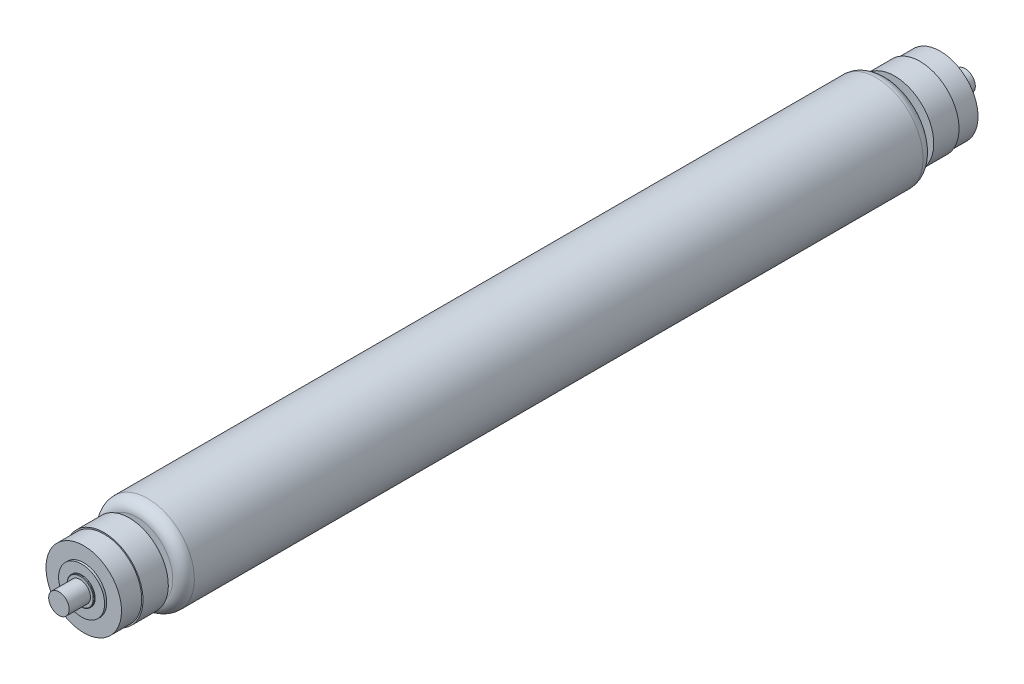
ISO-10303-21;
HEADER;
FILE_DESCRIPTION(('STEP AP214'),'2;1');
FILE_NAME('part.step','',(''),(''),'','','');
FILE_SCHEMA(('AUTOMOTIVE_DESIGN { 1 0 10303 214 1 1 1 1 }'));
ENDSEC;
DATA;
#1=APPLICATION_CONTEXT('core data for automotive mechanical design processes');
#2=APPLICATION_PROTOCOL_DEFINITION('international standard','automotive_design',2000,#1);
#3=PRODUCT_CONTEXT('',#1,'mechanical');
#4=PRODUCT('Part','Part','',(#3));
#5=PRODUCT_RELATED_PRODUCT_CATEGORY('part','',(#4));
#6=PRODUCT_DEFINITION_FORMATION('','',#4);
#7=PRODUCT_DEFINITION_CONTEXT('part definition',#1,'design');
#8=PRODUCT_DEFINITION('design','',#6,#7);
#9=PRODUCT_DEFINITION_SHAPE('','',#8);
#10=(LENGTH_UNIT() NAMED_UNIT(*) SI_UNIT(.MILLI.,.METRE.));
#11=(NAMED_UNIT(*) PLANE_ANGLE_UNIT() SI_UNIT($,.RADIAN.));
#12=(NAMED_UNIT(*) SI_UNIT($,.STERADIAN.) SOLID_ANGLE_UNIT());
#13=UNCERTAINTY_MEASURE_WITH_UNIT(LENGTH_MEASURE(1.E-05),#10,'distance_accuracy_value','');
#14=(GEOMETRIC_REPRESENTATION_CONTEXT(3) GLOBAL_UNCERTAINTY_ASSIGNED_CONTEXT((#13)) GLOBAL_UNIT_ASSIGNED_CONTEXT((#10,
#11,#12)) REPRESENTATION_CONTEXT('',''));
#15=CARTESIAN_POINT('',(0.,0.,0.));
#16=DIRECTION('',(0.,0.,1.));
#17=DIRECTION('',(1.,0.,0.));
#18=AXIS2_PLACEMENT_3D('',#15,#16,#17);
#19=CARTESIAN_POINT('',(0.,0.,0.));
#20=DIRECTION('',(0.,0.,-1.));
#21=DIRECTION('',(0.,1.,0.));
#22=AXIS2_PLACEMENT_3D('',#19,#20,#21);
#23=CYLINDRICAL_SURFACE('',#22,2.41300000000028);
#24=CARTESIAN_POINT('',(0.,0.,0.));
#25=DIRECTION('',(0.,0.,-1.));
#26=DIRECTION('',(0.,1.,0.));
#27=AXIS2_PLACEMENT_3D('',#24,#25,#26);
#28=CIRCLE('',#27,2.4130000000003);
#29=CARTESIAN_POINT('',(0.,2.4130000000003,0.));
#30=VERTEX_POINT('',#29);
#31=EDGE_CURVE('E127',#30,#30,#28,.T.);
#32=ORIENTED_EDGE('',*,*,#31,.F.);
#33=EDGE_LOOP('',(#32));
#34=FACE_BOUND('',#33,.T.);
#35=CARTESIAN_POINT('',(0.,0.,5.00380000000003));
#36=DIRECTION('',(0.,0.,-1.));
#37=DIRECTION('',(0.,1.,0.));
#38=AXIS2_PLACEMENT_3D('',#35,#36,#37);
#39=CIRCLE('',#38,2.41300000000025);
#40=CARTESIAN_POINT('',(0.,2.41300000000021,5.00380000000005));
#41=VERTEX_POINT('',#40);
#42=EDGE_CURVE('E10',#41,#41,#39,.T.);
#43=ORIENTED_EDGE('',*,*,#42,.T.);
#44=EDGE_LOOP('',(#43));
#45=FACE_BOUND('',#44,.T.);
#46=ADVANCED_FACE('F33',(#34,#45),#23,.T.);
#47=CARTESIAN_POINT('',(0.,-3.06447825,5.00379999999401));
#48=DIRECTION('',(0.,0.,1.));
#49=DIRECTION('',(0.,-1.,0.));
#50=AXIS2_PLACEMENT_3D('',#47,#48,#49);
#51=PLANE('',#50);
#52=ORIENTED_EDGE('',*,*,#42,.F.);
#53=EDGE_LOOP('',(#52));
#54=FACE_BOUND('',#53,.T.);
#55=CARTESIAN_POINT('',(0.,0.,5.00379999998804));
#56=DIRECTION('',(0.,0.,-1.));
#57=DIRECTION('',(0.,1.,0.));
#58=AXIS2_PLACEMENT_3D('',#55,#56,#57);
#59=CIRCLE('',#58,3.06447824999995);
#60=CARTESIAN_POINT('',(0.,3.06447824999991,5.00379999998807));
#61=VERTEX_POINT('',#60);
#62=EDGE_CURVE('E39',#61,#61,#59,.T.);
#63=ORIENTED_EDGE('',*,*,#62,.T.);
#64=EDGE_LOOP('',(#63));
#65=FACE_BOUND('',#64,.T.);
#66=ADVANCED_FACE('F134',(#54,#65),#51,.F.);
#67=CARTESIAN_POINT('',(0.,0.,5.13199024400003));
#68=DIRECTION('',(0.,0.,1.));
#69=DIRECTION('',(0.,-1.,0.));
#70=AXIS2_PLACEMENT_3D('',#67,#68,#69);
#71=CONICAL_SURFACE('',#70,3.19266874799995,0.785399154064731);
#72=ORIENTED_EDGE('',*,*,#62,.F.);
#73=EDGE_LOOP('',(#72));
#74=FACE_BOUND('',#73,.T.);
#75=CARTESIAN_POINT('',(0.,0.,5.13199024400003));
#76=DIRECTION('',(0.,0.,-1.));
#77=DIRECTION('',(0.,1.,0.));
#78=AXIS2_PLACEMENT_3D('',#75,#76,#77);
#79=CIRCLE('',#78,3.19266874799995);
#80=CARTESIAN_POINT('',(0.,3.19266874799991,5.13199024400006));
#81=VERTEX_POINT('',#80);
#82=EDGE_CURVE('E43',#81,#81,#79,.T.);
#83=ORIENTED_EDGE('',*,*,#82,.T.);
#84=EDGE_LOOP('',(#83));
#85=FACE_BOUND('',#84,.T.);
#86=ADVANCED_FACE('F138',(#74,#85),#71,.T.);
#87=CARTESIAN_POINT('',(0.,0.,0.));
#88=DIRECTION('',(0.,0.,-1.));
#89=DIRECTION('',(0.,1.,0.));
#90=AXIS2_PLACEMENT_3D('',#87,#88,#89);
#91=CYLINDRICAL_SURFACE('',#90,3.1926687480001);
#92=ORIENTED_EDGE('',*,*,#82,.F.);
#93=EDGE_LOOP('',(#92));
#94=FACE_BOUND('',#93,.T.);
#95=CARTESIAN_POINT('',(0.,0.,5.33400000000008));
#96=DIRECTION('',(0.,0.,-1.));
#97=DIRECTION('',(0.,1.,0.));
#98=AXIS2_PLACEMENT_3D('',#95,#96,#97);
#99=CIRCLE('',#98,3.19266874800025);
#100=CARTESIAN_POINT('',(0.,3.1926687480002,5.33400000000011));
#101=VERTEX_POINT('',#100);
#102=EDGE_CURVE('E47',#101,#101,#99,.T.);
#103=ORIENTED_EDGE('',*,*,#102,.T.);
#104=EDGE_LOOP('',(#103));
#105=FACE_BOUND('',#104,.T.);
#106=ADVANCED_FACE('F143',(#94,#105),#91,.T.);
#107=CARTESIAN_POINT('',(0.,-5.4102,5.33400000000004));
#108=DIRECTION('',(0.,0.,1.));
#109=DIRECTION('',(0.,-1.,0.));
#110=AXIS2_PLACEMENT_3D('',#107,#108,#109);
#111=PLANE('',#110);
#112=ORIENTED_EDGE('',*,*,#102,.F.);
#113=EDGE_LOOP('',(#112));
#114=FACE_BOUND('',#113,.T.);
#115=CARTESIAN_POINT('',(0.,0.,5.33400000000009));
#116=DIRECTION('',(0.,0.,-1.));
#117=DIRECTION('',(0.,1.,0.));
#118=AXIS2_PLACEMENT_3D('',#115,#116,#117);
#119=CIRCLE('',#118,5.41019999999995);
#120=CARTESIAN_POINT('',(0.,5.4101999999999,5.33400000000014));
#121=VERTEX_POINT('',#120);
#122=EDGE_CURVE('E52',#121,#121,#119,.T.);
#123=ORIENTED_EDGE('',*,*,#122,.T.);
#124=EDGE_LOOP('',(#123));
#125=FACE_BOUND('',#124,.T.);
#126=ADVANCED_FACE('F149',(#114,#125),#111,.F.);
#127=CARTESIAN_POINT('',(0.,0.,0.));
#128=DIRECTION('',(0.,0.,-1.));
#129=DIRECTION('',(0.,1.,0.));
#130=AXIS2_PLACEMENT_3D('',#127,#128,#129);
#131=CYLINDRICAL_SURFACE('',#130,5.41019999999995);
#132=ORIENTED_EDGE('',*,*,#122,.F.);
#133=EDGE_LOOP('',(#132));
#134=FACE_BOUND('',#133,.T.);
#135=CARTESIAN_POINT('',(0.,0.,5.84200000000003));
#136=DIRECTION('',(0.,0.,-1.));
#137=DIRECTION('',(0.,1.,0.));
#138=AXIS2_PLACEMENT_3D('',#135,#136,#137);
#139=CIRCLE('',#138,5.41019999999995);
#140=CARTESIAN_POINT('',(0.,5.41019999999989,5.84200000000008));
#141=VERTEX_POINT('',#140);
#142=EDGE_CURVE('E55',#141,#141,#139,.T.);
#143=ORIENTED_EDGE('',*,*,#142,.T.);
#144=EDGE_LOOP('',(#143));
#145=FACE_BOUND('',#144,.T.);
#146=ADVANCED_FACE('F153',(#134,#145),#131,.T.);
#147=CARTESIAN_POINT('',(0.,-8.884691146,5.84199999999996));
#148=DIRECTION('',(0.,0.,1.));
#149=DIRECTION('',(0.,-1.,0.));
#150=AXIS2_PLACEMENT_3D('',#147,#148,#149);
#151=PLANE('',#150);
#152=ORIENTED_EDGE('',*,*,#142,.F.);
#153=EDGE_LOOP('',(#152));
#154=FACE_BOUND('',#153,.T.);
#155=CARTESIAN_POINT('',(0.,0.,5.84200000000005));
#156=DIRECTION('',(0.,0.,-1.));
#157=DIRECTION('',(0.,1.,0.));
#158=AXIS2_PLACEMENT_3D('',#155,#156,#157);
#159=CIRCLE('',#158,8.88469114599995);
#160=CARTESIAN_POINT('',(0.,8.88469114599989,5.84200000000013));
#161=VERTEX_POINT('',#160);
#162=EDGE_CURVE('E58',#161,#161,#159,.T.);
#163=ORIENTED_EDGE('',*,*,#162,.T.);
#164=EDGE_LOOP('',(#163));
#165=FACE_BOUND('',#164,.T.);
#166=ADVANCED_FACE('F157',(#154,#165),#151,.F.);
#167=CARTESIAN_POINT('',(0.,0.,0.));
#168=DIRECTION('',(0.,0.,-1.));
#169=DIRECTION('',(0.,1.,0.));
#170=AXIS2_PLACEMENT_3D('',#167,#168,#169);
#171=CYLINDRICAL_SURFACE('',#170,8.88469114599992);
#172=ORIENTED_EDGE('',*,*,#162,.F.);
#173=EDGE_LOOP('',(#172));
#174=FACE_BOUND('',#173,.T.);
#175=CARTESIAN_POINT('',(0.,0.,10.6045000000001));
#176=DIRECTION('',(0.,0.,-1.));
#177=DIRECTION('',(0.,1.,0.));
#178=AXIS2_PLACEMENT_3D('',#175,#176,#177);
#179=CIRCLE('',#178,8.8846911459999);
#180=CARTESIAN_POINT('',(0.,8.88469114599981,10.6045000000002));
#181=VERTEX_POINT('',#180);
#182=EDGE_CURVE('E61',#181,#181,#179,.T.);
#183=ORIENTED_EDGE('',*,*,#182,.T.);
#184=EDGE_LOOP('',(#183));
#185=FACE_BOUND('',#184,.T.);
#186=ADVANCED_FACE('F161',(#174,#185),#171,.T.);
#187=CARTESIAN_POINT('',(0.,-9.1821,10.6045));
#188=DIRECTION('',(0.,0.,1.));
#189=DIRECTION('',(0.,-1.,0.));
#190=AXIS2_PLACEMENT_3D('',#187,#188,#189);
#191=PLANE('',#190);
#192=ORIENTED_EDGE('',*,*,#182,.F.);
#193=EDGE_LOOP('',(#192));
#194=FACE_BOUND('',#193,.T.);
#195=CARTESIAN_POINT('',(0.,0.,10.6045000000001));
#196=DIRECTION('',(0.,0.,-1.));
#197=DIRECTION('',(0.,1.,0.));
#198=AXIS2_PLACEMENT_3D('',#195,#196,#197);
#199=CIRCLE('',#198,9.1820999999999);
#200=CARTESIAN_POINT('',(0.,9.1820999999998,10.6045000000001));
#201=VERTEX_POINT('',#200);
#202=EDGE_CURVE('E64',#201,#201,#199,.T.);
#203=ORIENTED_EDGE('',*,*,#202,.T.);
#204=EDGE_LOOP('',(#203));
#205=FACE_BOUND('',#204,.T.);
#206=ADVANCED_FACE('F165',(#194,#205),#191,.F.);
#207=CARTESIAN_POINT('',(0.,0.,0.));
#208=DIRECTION('',(0.,0.,-1.));
#209=DIRECTION('',(0.,1.,0.));
#210=AXIS2_PLACEMENT_3D('',#207,#208,#209);
#211=CYLINDRICAL_SURFACE('',#210,9.18210000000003);
#212=ORIENTED_EDGE('',*,*,#202,.F.);
#213=EDGE_LOOP('',(#212));
#214=FACE_BOUND('',#213,.T.);
#215=CARTESIAN_POINT('',(0.,-1.51372246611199E-13,16.5608000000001));
#216=DIRECTION('',(0.,0.,-1.));
#217=DIRECTION('',(0.,1.,0.));
#218=AXIS2_PLACEMENT_3D('',#215,#216,#217);
#219=CIRCLE('',#218,9.18210000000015);
#220=CARTESIAN_POINT('',(0.,9.1821,16.5608000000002));
#221=VERTEX_POINT('',#220);
#222=EDGE_CURVE('E67',#221,#221,#219,.T.);
#223=ORIENTED_EDGE('',*,*,#222,.T.);
#224=EDGE_LOOP('',(#223));
#225=FACE_BOUND('',#224,.T.);
#226=ADVANCED_FACE('F169',(#214,#225),#211,.T.);
#227=CARTESIAN_POINT('',(0.,-6.3499999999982,16.5608000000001));
#228=DIRECTION('',(0.,0.,-1.));
#229=DIRECTION('',(0.,1.,0.));
#230=AXIS2_PLACEMENT_3D('',#227,#228,#229);
#231=PLANE('',#230);
#232=ORIENTED_EDGE('',*,*,#222,.F.);
#233=EDGE_LOOP('',(#232));
#234=FACE_BOUND('',#233,.T.);
#235=CARTESIAN_POINT('',(0.,-1.51372246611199E-13,16.5608000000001));
#236=DIRECTION('',(0.,0.,-1.));
#237=DIRECTION('',(0.,1.,0.));
#238=AXIS2_PLACEMENT_3D('',#235,#236,#237);
#239=CIRCLE('',#238,6.34999999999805);
#240=CARTESIAN_POINT('',(0.,6.3499999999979,16.5608000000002));
#241=VERTEX_POINT('',#240);
#242=EDGE_CURVE('E70',#241,#241,#239,.T.);
#243=ORIENTED_EDGE('',*,*,#242,.T.);
#244=EDGE_LOOP('',(#243));
#245=FACE_BOUND('',#244,.T.);
#246=ADVANCED_FACE('F173',(#234,#245),#231,.F.);
#247=CARTESIAN_POINT('',(0.,-1.67623868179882E-13,18.3387999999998));
#248=DIRECTION('',(0.,0.,-1.));
#249=DIRECTION('',(0.,1.,0.));
#250=AXIS2_PLACEMENT_3D('',#247,#248,#249);
#251=CONICAL_SURFACE('',#250,4.20728205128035,0.878154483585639);
#252=ORIENTED_EDGE('',*,*,#242,.F.);
#253=EDGE_LOOP('',(#252));
#254=FACE_BOUND('',#253,.T.);
#255=CARTESIAN_POINT('',(0.,-1.67623868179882E-13,18.3387999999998));
#256=DIRECTION('',(0.,0.,-1.));
#257=DIRECTION('',(0.,1.,0.));
#258=AXIS2_PLACEMENT_3D('',#255,#256,#257);
#259=CIRCLE('',#258,4.20728205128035);
#260=CARTESIAN_POINT('',(0.,4.20728205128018,18.3387999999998));
#261=VERTEX_POINT('',#260);
#262=EDGE_CURVE('E73',#261,#261,#259,.T.);
#263=ORIENTED_EDGE('',*,*,#262,.T.);
#264=EDGE_LOOP('',(#263));
#265=FACE_BOUND('',#264,.T.);
#266=ADVANCED_FACE('F177',(#254,#265),#251,.T.);
#267=CARTESIAN_POINT('',(0.,-4.20728205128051,18.3387999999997));
#268=DIRECTION('',(0.,0.,1.));
#269=DIRECTION('',(0.,-1.,0.));
#270=AXIS2_PLACEMENT_3D('',#267,#268,#269);
#271=PLANE('',#270);
#272=ORIENTED_EDGE('',*,*,#262,.F.);
#273=EDGE_LOOP('',(#272));
#274=FACE_BOUND('',#273,.T.);
#275=CARTESIAN_POINT('',(0.,-1.67623868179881E-13,18.3387999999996));
#276=DIRECTION('',(0.,0.,-1.));
#277=DIRECTION('',(0.,1.,0.));
#278=AXIS2_PLACEMENT_3D('',#275,#276,#277);
#279=CIRCLE('',#278,8.44549999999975);
#280=CARTESIAN_POINT('',(0.,8.44549999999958,18.3387999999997));
#281=VERTEX_POINT('',#280);
#282=EDGE_CURVE('E76',#281,#281,#279,.T.);
#283=ORIENTED_EDGE('',*,*,#282,.T.);
#284=EDGE_LOOP('',(#283));
#285=FACE_BOUND('',#284,.T.);
#286=ADVANCED_FACE('F181',(#274,#285),#271,.F.);
#287=CARTESIAN_POINT('',(0.,-1.90819582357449E-13,20.8787999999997));
#288=DIRECTION('',(0.,0.,-1.));
#289=DIRECTION('',(0.,1.,0.));
#290=AXIS2_PLACEMENT_3D('',#287,#288,#289);
#291=TOROIDAL_SURFACE('',#290,8.44549999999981,2.54);
#292=ORIENTED_EDGE('',*,*,#282,.F.);
#293=EDGE_LOOP('',(#292));
#294=FACE_BOUND('',#293,.T.);
#295=CARTESIAN_POINT('',(0.,-1.90840470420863E-13,20.8787999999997));
#296=DIRECTION('',(0.,0.,-1.));
#297=DIRECTION('',(0.,1.,0.));
#298=AXIS2_PLACEMENT_3D('',#295,#296,#297);
#299=CIRCLE('',#298,10.9854999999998);
#300=CARTESIAN_POINT('',(0.,10.9854999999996,20.8787999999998));
#301=VERTEX_POINT('',#300);
#302=EDGE_CURVE('E79',#301,#301,#299,.T.);
#303=ORIENTED_EDGE('',*,*,#302,.T.);
#304=EDGE_LOOP('',(#303));
#305=FACE_BOUND('',#304,.T.);
#306=ADVANCED_FACE('F185',(#294,#305),#291,.T.);
#307=CARTESIAN_POINT('',(0.,0.,0.));
#308=DIRECTION('',(0.,0.,-1.));
#309=DIRECTION('',(0.,1.,0.));
#310=AXIS2_PLACEMENT_3D('',#307,#308,#309);
#311=CYLINDRICAL_SURFACE('',#310,10.985499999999);
#312=ORIENTED_EDGE('',*,*,#302,.F.);
#313=EDGE_LOOP('',(#312));
#314=FACE_BOUND('',#313,.T.);
#315=CARTESIAN_POINT('',(0.,-1.75796112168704E-12,192.328799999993));
#316=DIRECTION('',(0.,0.,-1.));
#317=DIRECTION('',(0.,1.,0.));
#318=AXIS2_PLACEMENT_3D('',#315,#316,#317);
#319=CIRCLE('',#318,10.9854999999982);
#320=CARTESIAN_POINT('',(0.,10.9854999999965,192.328799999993));
#321=VERTEX_POINT('',#320);
#322=EDGE_CURVE('E82',#321,#321,#319,.T.);
#323=ORIENTED_EDGE('',*,*,#322,.T.);
#324=EDGE_LOOP('',(#323));
#325=FACE_BOUND('',#324,.T.);
#326=ADVANCED_FACE('F189',(#314,#325),#311,.T.);
#327=CARTESIAN_POINT('',(0.,-1.75727488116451E-12,192.328799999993));
#328=DIRECTION('',(0.,0.,-1.));
#329=DIRECTION('',(0.,1.,0.));
#330=AXIS2_PLACEMENT_3D('',#327,#328,#329);
#331=TOROIDAL_SURFACE('',#330,8.44549999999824,2.53999999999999);
#332=ORIENTED_EDGE('',*,*,#322,.F.);
#333=EDGE_LOOP('',(#332));
#334=FACE_BOUND('',#333,.T.);
#335=CARTESIAN_POINT('',(0.,-1.78117772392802E-12,194.868799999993));
#336=DIRECTION('',(0.,0.,-1.));
#337=DIRECTION('',(0.,1.,0.));
#338=AXIS2_PLACEMENT_3D('',#335,#336,#337);
#339=CIRCLE('',#338,8.44549999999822);
#340=CARTESIAN_POINT('',(0.,8.44549999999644,194.868799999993));
#341=VERTEX_POINT('',#340);
#342=EDGE_CURVE('E85',#341,#341,#339,.T.);
#343=ORIENTED_EDGE('',*,*,#342,.T.);
#344=EDGE_LOOP('',(#343));
#345=FACE_BOUND('',#344,.T.);
#346=ADVANCED_FACE('F193',(#334,#345),#331,.T.);
#347=CARTESIAN_POINT('',(0.,-4.20728205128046,194.868799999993));
#348=DIRECTION('',(0.,0.,-1.));
#349=DIRECTION('',(0.,1.,0.));
#350=AXIS2_PLACEMENT_3D('',#347,#348,#349);
#351=PLANE('',#350);
#352=ORIENTED_EDGE('',*,*,#342,.F.);
#353=EDGE_LOOP('',(#352));
#354=FACE_BOUND('',#353,.T.);
#355=CARTESIAN_POINT('',(0.,-1.78117772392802E-12,194.868799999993));
#356=DIRECTION('',(0.,0.,-1.));
#357=DIRECTION('',(0.,1.,0.));
#358=AXIS2_PLACEMENT_3D('',#355,#356,#357);
#359=CIRCLE('',#358,4.20728205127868);
#360=CARTESIAN_POINT('',(0.,4.2072820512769,194.868799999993));
#361=VERTEX_POINT('',#360);
#362=EDGE_CURVE('E88',#361,#361,#359,.T.);
#363=ORIENTED_EDGE('',*,*,#362,.T.);
#364=EDGE_LOOP('',(#363));
#365=FACE_BOUND('',#364,.T.);
#366=ADVANCED_FACE('F197',(#354,#365),#351,.F.);
#367=CARTESIAN_POINT('',(0.,-1.7974293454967E-12,196.646799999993));
#368=DIRECTION('',(0.,0.,1.));
#369=DIRECTION('',(0.,-1.,0.));
#370=AXIS2_PLACEMENT_3D('',#367,#368,#369);
#371=CONICAL_SURFACE('',#370,6.34999999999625,0.878154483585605);
#372=ORIENTED_EDGE('',*,*,#362,.F.);
#373=EDGE_LOOP('',(#372));
#374=FACE_BOUND('',#373,.T.);
#375=CARTESIAN_POINT('',(0.,-1.7974293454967E-12,196.646799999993));
#376=DIRECTION('',(0.,0.,-1.));
#377=DIRECTION('',(0.,1.,0.));
#378=AXIS2_PLACEMENT_3D('',#375,#376,#377);
#379=CIRCLE('',#378,6.34999999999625);
#380=CARTESIAN_POINT('',(0.,6.34999999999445,196.646799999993));
#381=VERTEX_POINT('',#380);
#382=EDGE_CURVE('E91',#381,#381,#379,.T.);
#383=ORIENTED_EDGE('',*,*,#382,.T.);
#384=EDGE_LOOP('',(#383));
#385=FACE_BOUND('',#384,.T.);
#386=ADVANCED_FACE('F201',(#374,#385),#371,.T.);
#387=CARTESIAN_POINT('',(0.,-6.34999999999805,196.646799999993));
#388=DIRECTION('',(0.,0.,1.));
#389=DIRECTION('',(0.,-1.,0.));
#390=AXIS2_PLACEMENT_3D('',#387,#388,#389);
#391=PLANE('',#390);
#392=ORIENTED_EDGE('',*,*,#382,.F.);
#393=EDGE_LOOP('',(#392));
#394=FACE_BOUND('',#393,.T.);
#395=CARTESIAN_POINT('',(0.,-1.7974293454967E-12,196.646799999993));
#396=DIRECTION('',(0.,0.,-1.));
#397=DIRECTION('',(0.,1.,0.));
#398=AXIS2_PLACEMENT_3D('',#395,#396,#397);
#399=CIRCLE('',#398,9.18209999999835);
#400=CARTESIAN_POINT('',(0.,9.18209999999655,196.646799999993));
#401=VERTEX_POINT('',#400);
#402=EDGE_CURVE('E94',#401,#401,#399,.T.);
#403=ORIENTED_EDGE('',*,*,#402,.T.);
#404=EDGE_LOOP('',(#403));
#405=FACE_BOUND('',#404,.T.);
#406=ADVANCED_FACE('F205',(#394,#405),#391,.F.);
#407=CARTESIAN_POINT('',(0.,0.,0.));
#408=DIRECTION('',(0.,0.,-1.));
#409=DIRECTION('',(0.,1.,0.));
#410=AXIS2_PLACEMENT_3D('',#407,#408,#409);
#411=CYLINDRICAL_SURFACE('',#410,9.18209999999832);
#412=ORIENTED_EDGE('',*,*,#402,.F.);
#413=EDGE_LOOP('',(#412));
#414=FACE_BOUND('',#413,.T.);
#415=CARTESIAN_POINT('',(0.,-1.8518722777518E-12,202.603099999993));
#416=DIRECTION('',(0.,0.,-1.));
#417=DIRECTION('',(0.,1.,0.));
#418=AXIS2_PLACEMENT_3D('',#415,#416,#417);
#419=CIRCLE('',#418,9.18209999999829);
#420=CARTESIAN_POINT('',(0.,9.18209999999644,202.603099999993));
#421=VERTEX_POINT('',#420);
#422=EDGE_CURVE('E97',#421,#421,#419,.T.);
#423=ORIENTED_EDGE('',*,*,#422,.T.);
#424=EDGE_LOOP('',(#423));
#425=FACE_BOUND('',#424,.T.);
#426=ADVANCED_FACE('F209',(#414,#425),#411,.T.);
#427=CARTESIAN_POINT('',(0.,-9.18210000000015,202.603099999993));
#428=DIRECTION('',(0.,0.,-1.));
#429=DIRECTION('',(0.,1.,0.));
#430=AXIS2_PLACEMENT_3D('',#427,#428,#429);
#431=PLANE('',#430);
#432=ORIENTED_EDGE('',*,*,#422,.F.);
#433=EDGE_LOOP('',(#432));
#434=FACE_BOUND('',#433,.T.);
#435=CARTESIAN_POINT('',(0.,-1.8518722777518E-12,202.603099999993));
#436=DIRECTION('',(0.,0.,-1.));
#437=DIRECTION('',(0.,1.,0.));
#438=AXIS2_PLACEMENT_3D('',#435,#436,#437);
#439=CIRCLE('',#438,8.88469114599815);
#440=CARTESIAN_POINT('',(0.,8.88469114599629,202.603099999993));
#441=VERTEX_POINT('',#440);
#442=EDGE_CURVE('E100',#441,#441,#439,.T.);
#443=ORIENTED_EDGE('',*,*,#442,.T.);
#444=EDGE_LOOP('',(#443));
#445=FACE_BOUND('',#444,.T.);
#446=ADVANCED_FACE('F213',(#434,#445),#431,.F.);
#447=CARTESIAN_POINT('',(0.,0.,0.));
#448=DIRECTION('',(0.,0.,-1.));
#449=DIRECTION('',(0.,1.,0.));
#450=AXIS2_PLACEMENT_3D('',#447,#448,#449);
#451=CYLINDRICAL_SURFACE('',#450,8.88469114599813);
#452=ORIENTED_EDGE('',*,*,#442,.F.);
#453=EDGE_LOOP('',(#452));
#454=FACE_BOUND('',#453,.T.);
#455=CARTESIAN_POINT('',(0.,-1.89540340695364E-12,207.365599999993));
#456=DIRECTION('',(0.,0.,-1.));
#457=DIRECTION('',(0.,1.,0.));
#458=AXIS2_PLACEMENT_3D('',#455,#456,#457);
#459=CIRCLE('',#458,8.8846911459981);
#460=CARTESIAN_POINT('',(0.,8.88469114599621,207.365599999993));
#461=VERTEX_POINT('',#460);
#462=EDGE_CURVE('E103',#461,#461,#459,.T.);
#463=ORIENTED_EDGE('',*,*,#462,.T.);
#464=EDGE_LOOP('',(#463));
#465=FACE_BOUND('',#464,.T.);
#466=ADVANCED_FACE('F217',(#454,#465),#451,.T.);
#467=CARTESIAN_POINT('',(0.,-8.884691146,207.365599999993));
#468=DIRECTION('',(0.,0.,-1.));
#469=DIRECTION('',(0.,1.,0.));
#470=AXIS2_PLACEMENT_3D('',#467,#468,#469);
#471=PLANE('',#470);
#472=ORIENTED_EDGE('',*,*,#462,.F.);
#473=EDGE_LOOP('',(#472));
#474=FACE_BOUND('',#473,.T.);
#475=CARTESIAN_POINT('',(0.,-1.89540340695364E-12,207.365599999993));
#476=DIRECTION('',(0.,0.,-1.));
#477=DIRECTION('',(0.,1.,0.));
#478=AXIS2_PLACEMENT_3D('',#475,#476,#477);
#479=CIRCLE('',#478,5.4101999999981);
#480=CARTESIAN_POINT('',(0.,5.41019999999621,207.365599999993));
#481=VERTEX_POINT('',#480);
#482=EDGE_CURVE('E106',#481,#481,#479,.T.);
#483=ORIENTED_EDGE('',*,*,#482,.T.);
#484=EDGE_LOOP('',(#483));
#485=FACE_BOUND('',#484,.T.);
#486=ADVANCED_FACE('F221',(#474,#485),#471,.F.);
#487=CARTESIAN_POINT('',(0.,0.,0.));
#488=DIRECTION('',(0.,0.,-1.));
#489=DIRECTION('',(0.,1.,0.));
#490=AXIS2_PLACEMENT_3D('',#487,#488,#489);
#491=CYLINDRICAL_SURFACE('',#490,5.4101999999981);
#492=ORIENTED_EDGE('',*,*,#482,.F.);
#493=EDGE_LOOP('',(#492));
#494=FACE_BOUND('',#493,.T.);
#495=CARTESIAN_POINT('',(0.,-1.90004672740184E-12,207.873599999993));
#496=DIRECTION('',(0.,0.,-1.));
#497=DIRECTION('',(0.,1.,0.));
#498=AXIS2_PLACEMENT_3D('',#495,#496,#497);
#499=CIRCLE('',#498,5.4101999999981);
#500=CARTESIAN_POINT('',(0.,5.4101999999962,207.873599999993));
#501=VERTEX_POINT('',#500);
#502=EDGE_CURVE('E109',#501,#501,#499,.T.);
#503=ORIENTED_EDGE('',*,*,#502,.T.);
#504=EDGE_LOOP('',(#503));
#505=FACE_BOUND('',#504,.T.);
#506=ADVANCED_FACE('F225',(#494,#505),#491,.T.);
#507=CARTESIAN_POINT('',(0.,-5.4102,207.873599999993));
#508=DIRECTION('',(0.,0.,-1.));
#509=DIRECTION('',(0.,1.,0.));
#510=AXIS2_PLACEMENT_3D('',#507,#508,#509);
#511=PLANE('',#510);
#512=ORIENTED_EDGE('',*,*,#502,.F.);
#513=EDGE_LOOP('',(#512));
#514=FACE_BOUND('',#513,.T.);
#515=CARTESIAN_POINT('',(0.,-1.90004672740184E-12,207.873599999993));
#516=DIRECTION('',(0.,0.,-1.));
#517=DIRECTION('',(0.,1.,0.));
#518=AXIS2_PLACEMENT_3D('',#515,#516,#517);
#519=CIRCLE('',#518,3.19266874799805);
#520=CARTESIAN_POINT('',(0.,3.19266874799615,207.873599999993));
#521=VERTEX_POINT('',#520);
#522=EDGE_CURVE('E112',#521,#521,#519,.T.);
#523=ORIENTED_EDGE('',*,*,#522,.T.);
#524=EDGE_LOOP('',(#523));
#525=FACE_BOUND('',#524,.T.);
#526=ADVANCED_FACE('F229',(#514,#525),#511,.F.);
#527=CARTESIAN_POINT('',(0.,0.,0.));
#528=DIRECTION('',(0.,0.,-1.));
#529=DIRECTION('',(0.,1.,0.));
#530=AXIS2_PLACEMENT_3D('',#527,#528,#529);
#531=CYLINDRICAL_SURFACE('',#530,3.19266874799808);
#532=ORIENTED_EDGE('',*,*,#522,.F.);
#533=EDGE_LOOP('',(#532));
#534=FACE_BOUND('',#533,.T.);
#535=CARTESIAN_POINT('',(0.,-1.90189317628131E-12,208.075609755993));
#536=DIRECTION('',(0.,0.,-1.));
#537=DIRECTION('',(0.,1.,0.));
#538=AXIS2_PLACEMENT_3D('',#535,#536,#537);
#539=CIRCLE('',#538,3.1926687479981);
#540=CARTESIAN_POINT('',(0.,3.1926687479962,208.075609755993));
#541=VERTEX_POINT('',#540);
#542=EDGE_CURVE('E115',#541,#541,#539,.T.);
#543=ORIENTED_EDGE('',*,*,#542,.T.);
#544=EDGE_LOOP('',(#543));
#545=FACE_BOUND('',#544,.T.);
#546=ADVANCED_FACE('F233',(#534,#545),#531,.T.);
#547=CARTESIAN_POINT('',(0.,-1.90306488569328E-12,208.203800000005));
#548=DIRECTION('',(0.,0.,-1.));
#549=DIRECTION('',(0.,1.,0.));
#550=AXIS2_PLACEMENT_3D('',#547,#548,#549);
#551=CONICAL_SURFACE('',#550,3.0644782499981,0.785399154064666);
#552=ORIENTED_EDGE('',*,*,#542,.F.);
#553=EDGE_LOOP('',(#552));
#554=FACE_BOUND('',#553,.T.);
#555=CARTESIAN_POINT('',(0.,-1.90306488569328E-12,208.203800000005));
#556=DIRECTION('',(0.,0.,-1.));
#557=DIRECTION('',(0.,1.,0.));
#558=AXIS2_PLACEMENT_3D('',#555,#556,#557);
#559=CIRCLE('',#558,3.0644782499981);
#560=CARTESIAN_POINT('',(0.,3.06447824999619,208.203800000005));
#561=VERTEX_POINT('',#560);
#562=EDGE_CURVE('E118',#561,#561,#559,.T.);
#563=ORIENTED_EDGE('',*,*,#562,.T.);
#564=EDGE_LOOP('',(#563));
#565=FACE_BOUND('',#564,.T.);
#566=ADVANCED_FACE('F237',(#554,#565),#551,.T.);
#567=CARTESIAN_POINT('',(0.,-3.06447825,208.203799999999));
#568=DIRECTION('',(0.,0.,-1.));
#569=DIRECTION('',(0.,1.,0.));
#570=AXIS2_PLACEMENT_3D('',#567,#568,#569);
#571=PLANE('',#570);
#572=ORIENTED_EDGE('',*,*,#562,.F.);
#573=EDGE_LOOP('',(#572));
#574=FACE_BOUND('',#573,.T.);
#575=CARTESIAN_POINT('',(0.,-1.90306488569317E-12,208.203799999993));
#576=DIRECTION('',(0.,0.,-1.));
#577=DIRECTION('',(0.,1.,0.));
#578=AXIS2_PLACEMENT_3D('',#575,#576,#577);
#579=CIRCLE('',#578,2.4129999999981);
#580=CARTESIAN_POINT('',(0.,2.41299999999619,208.203799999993));
#581=VERTEX_POINT('',#580);
#582=EDGE_CURVE('E121',#581,#581,#579,.T.);
#583=ORIENTED_EDGE('',*,*,#582,.T.);
#584=EDGE_LOOP('',(#583));
#585=FACE_BOUND('',#584,.T.);
#586=ADVANCED_FACE('F241',(#574,#585),#571,.F.);
#587=CARTESIAN_POINT('',(0.,0.,0.));
#588=DIRECTION('',(0.,0.,-1.));
#589=DIRECTION('',(0.,1.,0.));
#590=AXIS2_PLACEMENT_3D('',#587,#588,#589);
#591=CYLINDRICAL_SURFACE('',#590,2.41299999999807);
#592=ORIENTED_EDGE('',*,*,#582,.F.);
#593=EDGE_LOOP('',(#592));
#594=FACE_BOUND('',#593,.T.);
#595=CARTESIAN_POINT('',(0.,-1.9488015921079E-12,213.207599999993));
#596=DIRECTION('',(0.,0.,-1.));
#597=DIRECTION('',(0.,1.,0.));
#598=AXIS2_PLACEMENT_3D('',#595,#596,#597);
#599=CIRCLE('',#598,2.41299999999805);
#600=CARTESIAN_POINT('',(0.,2.4129999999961,213.207599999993));
#601=VERTEX_POINT('',#600);
#602=EDGE_CURVE('E124',#601,#601,#599,.T.);
#603=ORIENTED_EDGE('',*,*,#602,.T.);
#604=EDGE_LOOP('',(#603));
#605=FACE_BOUND('',#604,.T.);
#606=ADVANCED_FACE('F245',(#594,#605),#591,.T.);
#607=CARTESIAN_POINT('',(0.,-2.413,213.207599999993));
#608=DIRECTION('',(0.,0.,-1.));
#609=DIRECTION('',(0.,1.,0.));
#610=AXIS2_PLACEMENT_3D('',#607,#608,#609);
#611=PLANE('',#610);
#612=ORIENTED_EDGE('',*,*,#602,.F.);
#613=EDGE_LOOP('',(#612));
#614=FACE_BOUND('',#613,.T.);
#615=ADVANCED_FACE('F249',(#614),#611,.F.);
#616=CARTESIAN_POINT('',(0.,-2.4130000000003,0.));
#617=DIRECTION('',(0.,0.,1.));
#618=DIRECTION('',(0.,-1.,0.));
#619=AXIS2_PLACEMENT_3D('',#616,#617,#618);
#620=PLANE('',#619);
#621=ORIENTED_EDGE('',*,*,#31,.T.);
#622=EDGE_LOOP('',(#621));
#623=FACE_BOUND('',#622,.T.);
#624=ADVANCED_FACE('F131',(#623),#620,.F.);
#625=CLOSED_SHELL('',(#46,#66,#86,#106,#126,#146,#166,#186,#206,#226,#246,#266,#286,#306,#326,
#346,#366,#386,#406,#426,#446,#466,#486,#506,#526,#546,#566,#586,#606,#615,#624));
#626=MANIFOLD_SOLID_BREP('B2',#625);
#627=ADVANCED_BREP_SHAPE_REPRESENTATION('',(#18,#626),#14);
#628=SHAPE_DEFINITION_REPRESENTATION(#9,#627);
ENDSEC;
END-ISO-10303-21;
